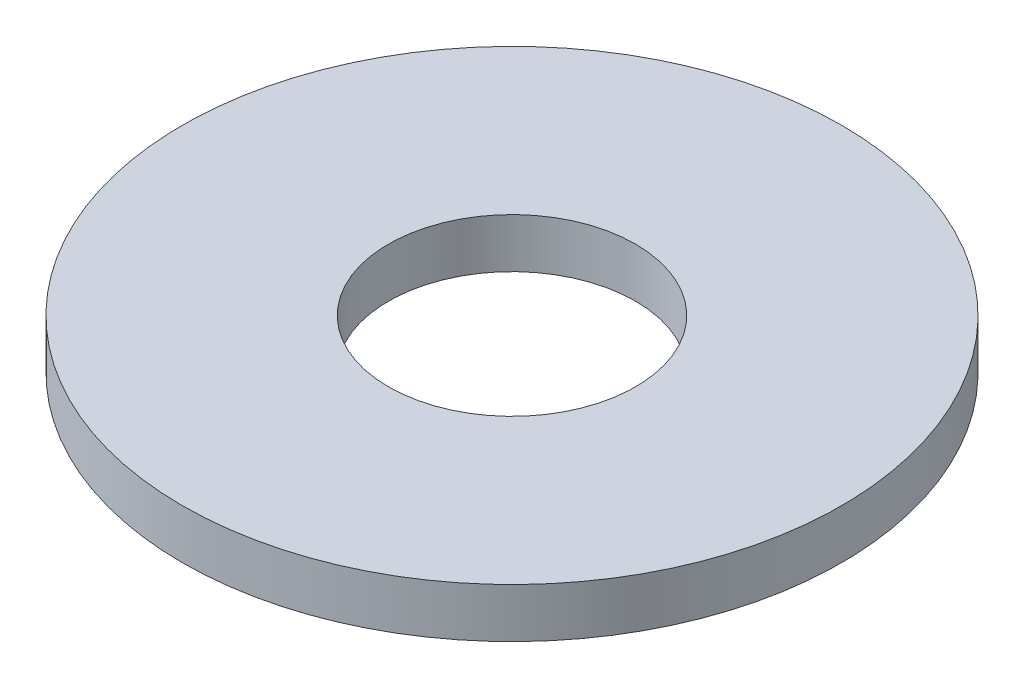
ISO-10303-21;
HEADER;
FILE_DESCRIPTION(('STEP AP214'),'2;1');
FILE_NAME('part.step','',(''),(''),'','','');
FILE_SCHEMA(('AUTOMOTIVE_DESIGN { 1 0 10303 214 1 1 1 1 }'));
ENDSEC;
DATA;
#1=APPLICATION_CONTEXT('core data for automotive mechanical design processes');
#2=APPLICATION_PROTOCOL_DEFINITION('international standard','automotive_design',2000,#1);
#3=PRODUCT_CONTEXT('',#1,'mechanical');
#4=PRODUCT('Part','Part','',(#3));
#5=PRODUCT_RELATED_PRODUCT_CATEGORY('part','',(#4));
#6=PRODUCT_DEFINITION_FORMATION('','',#4);
#7=PRODUCT_DEFINITION_CONTEXT('part definition',#1,'design');
#8=PRODUCT_DEFINITION('design','',#6,#7);
#9=PRODUCT_DEFINITION_SHAPE('','',#8);
#10=(LENGTH_UNIT() NAMED_UNIT(*) SI_UNIT(.MILLI.,.METRE.));
#11=(NAMED_UNIT(*) PLANE_ANGLE_UNIT() SI_UNIT($,.RADIAN.));
#12=(NAMED_UNIT(*) SI_UNIT($,.STERADIAN.) SOLID_ANGLE_UNIT());
#13=UNCERTAINTY_MEASURE_WITH_UNIT(LENGTH_MEASURE(1.E-05),#10,'distance_accuracy_value','');
#14=(GEOMETRIC_REPRESENTATION_CONTEXT(3) GLOBAL_UNCERTAINTY_ASSIGNED_CONTEXT((#13)) GLOBAL_UNIT_ASSIGNED_CONTEXT((#10,
#11,#12)) REPRESENTATION_CONTEXT('',''));
#15=CARTESIAN_POINT('',(0.,0.,0.));
#16=DIRECTION('',(0.,0.,1.));
#17=DIRECTION('',(1.,0.,0.));
#18=AXIS2_PLACEMENT_3D('',#15,#16,#17);
#19=CARTESIAN_POINT('',(0.,0.3,0.));
#20=DIRECTION('',(0.,1.,0.));
#21=DIRECTION('',(0.,0.,1.));
#22=AXIS2_PLACEMENT_3D('',#19,#20,#21);
#23=PLANE('',#22);
#24=CARTESIAN_POINT('',(0.,0.3,0.));
#25=DIRECTION('',(0.,1.,0.));
#26=DIRECTION('',(0.,0.,1.));
#27=AXIS2_PLACEMENT_3D('',#24,#25,#26);
#28=CIRCLE('',#27,2.);
#29=CARTESIAN_POINT('',(0.,0.3,2.));
#30=VERTEX_POINT('',#29);
#31=EDGE_CURVE('E10',#30,#30,#28,.T.);
#32=ORIENTED_EDGE('',*,*,#31,.T.);
#33=EDGE_LOOP('',(#32));
#34=FACE_BOUND('',#33,.T.);
#35=CARTESIAN_POINT('',(0.,0.3,0.));
#36=DIRECTION('',(0.,1.,0.));
#37=DIRECTION('',(0.,0.,1.));
#38=AXIS2_PLACEMENT_3D('',#35,#36,#37);
#39=CIRCLE('',#38,0.75);
#40=CARTESIAN_POINT('',(0.,0.3,0.75));
#41=VERTEX_POINT('',#40);
#42=EDGE_CURVE('E39',#41,#41,#39,.T.);
#43=ORIENTED_EDGE('',*,*,#42,.F.);
#44=EDGE_LOOP('',(#43));
#45=FACE_BOUND('',#44,.T.);
#46=ADVANCED_FACE('F28',(#34,#45),#23,.T.);
#47=CARTESIAN_POINT('',(0.,0.,0.));
#48=DIRECTION('',(0.,1.,0.));
#49=DIRECTION('',(0.,0.,1.));
#50=AXIS2_PLACEMENT_3D('',#47,#48,#49);
#51=PLANE('',#50);
#52=CARTESIAN_POINT('',(0.,0.,0.));
#53=DIRECTION('',(0.,1.,0.));
#54=DIRECTION('',(0.,0.,1.));
#55=AXIS2_PLACEMENT_3D('',#52,#53,#54);
#56=CIRCLE('',#55,2.);
#57=CARTESIAN_POINT('',(0.,0.,2.));
#58=VERTEX_POINT('',#57);
#59=EDGE_CURVE('E35',#58,#58,#56,.T.);
#60=ORIENTED_EDGE('',*,*,#59,.F.);
#61=EDGE_LOOP('',(#60));
#62=FACE_BOUND('',#61,.T.);
#63=CARTESIAN_POINT('',(0.,0.,0.));
#64=DIRECTION('',(0.,1.,0.));
#65=DIRECTION('',(0.,0.,1.));
#66=AXIS2_PLACEMENT_3D('',#63,#64,#65);
#67=CIRCLE('',#66,0.75);
#68=CARTESIAN_POINT('',(0.,0.,0.75));
#69=VERTEX_POINT('',#68);
#70=EDGE_CURVE('E43',#69,#69,#67,.T.);
#71=ORIENTED_EDGE('',*,*,#70,.T.);
#72=EDGE_LOOP('',(#71));
#73=FACE_BOUND('',#72,.T.);
#74=ADVANCED_FACE('F49',(#62,#73),#51,.F.);
#75=CARTESIAN_POINT('',(0.,0.3,0.));
#76=DIRECTION('',(0.,-1.,0.));
#77=DIRECTION('',(0.,0.,-1.));
#78=AXIS2_PLACEMENT_3D('',#75,#76,#77);
#79=CYLINDRICAL_SURFACE('',#78,2.);
#80=ORIENTED_EDGE('',*,*,#31,.F.);
#81=EDGE_LOOP('',(#80));
#82=FACE_BOUND('',#81,.T.);
#83=ORIENTED_EDGE('',*,*,#59,.T.);
#84=EDGE_LOOP('',(#83));
#85=FACE_BOUND('',#84,.T.);
#86=ADVANCED_FACE('F30',(#82,#85),#79,.T.);
#87=CARTESIAN_POINT('',(0.,0.3,0.));
#88=DIRECTION('',(0.,-1.,0.));
#89=DIRECTION('',(0.,0.,-1.));
#90=AXIS2_PLACEMENT_3D('',#87,#88,#89);
#91=CYLINDRICAL_SURFACE('',#90,0.75);
#92=ORIENTED_EDGE('',*,*,#42,.T.);
#93=EDGE_LOOP('',(#92));
#94=FACE_BOUND('',#93,.T.);
#95=ORIENTED_EDGE('',*,*,#70,.F.);
#96=EDGE_LOOP('',(#95));
#97=FACE_BOUND('',#96,.T.);
#98=ADVANCED_FACE('F51',(#94,#97),#91,.F.);
#99=CLOSED_SHELL('',(#46,#74,#86,#98));
#100=MANIFOLD_SOLID_BREP('B2',#99);
#101=ADVANCED_BREP_SHAPE_REPRESENTATION('',(#18,#100),#14);
#102=SHAPE_DEFINITION_REPRESENTATION(#9,#101);
ENDSEC;
END-ISO-10303-21;
